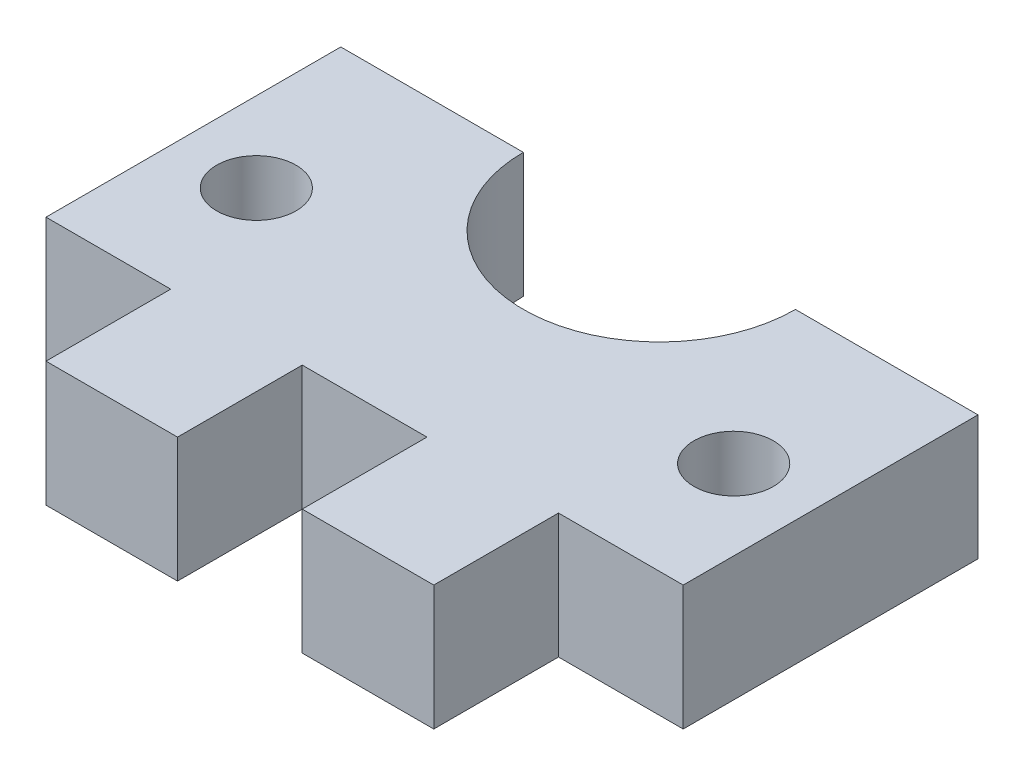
from build123d import *

# Parameters (mm, degrees)
SKETCH1_R           = 1.75
BOSS_EXTRUDE1_DEPTH = 5.5


with BuildPart() as part:
    # Sketch1 → Boss-Extrude1 (new body)
    with BuildSketch(Plane(origin=(0, 0, 0), x_dir=(1, 0, 0), z_dir=(0, 1, 0))):
        with BuildLine():
            Line((-14.55, 18.5), (-22.6, 18.5))
            Line((-22.6, 18.5), (-22.6, 5.5))
            Line((-22.6, 5.5), (-19.85, 5.5))
            Line((-19.85, 5.5), (-17.1, 5.5))
            Line((-17.1, 5.5), (-17.1, 0))
            Line((-17.1, 0), (-11.3, 0))
            Line((-11.3, 0), (-11.3, 5.5))
            Line((-11.3, 5.5), (-5.8, 5.5))
            Line((-5.8, 5.5), (-5.8, 0))
            Line((-5.8, 0), (0, 0))
            Line((0, 0), (0, 5.5))
            Line((0, 5.5), (2.75, 5.5))
            Line((2.75, 5.5), (5.5, 5.5))
            Line((5.5, 5.5), (5.5, 18.5))
            Line((5.5, 18.5), (-2.55, 18.5))
            ThreePointArc((-2.55, 18.5), (-8.55, 12.5), (-14.55, 18.5))
        make_face()
        with Locations(Location((-19.075, 11.25, 0), (0, 0, 270))):
            Circle(SKETCH1_R, mode=Mode.SUBTRACT)
        with Locations(Location((1.975, 11.25, 0), (0, 0, 270))):
            Circle(SKETCH1_R, mode=Mode.SUBTRACT)
    extrude(amount=BOSS_EXTRUDE1_DEPTH)


solid = part.part
